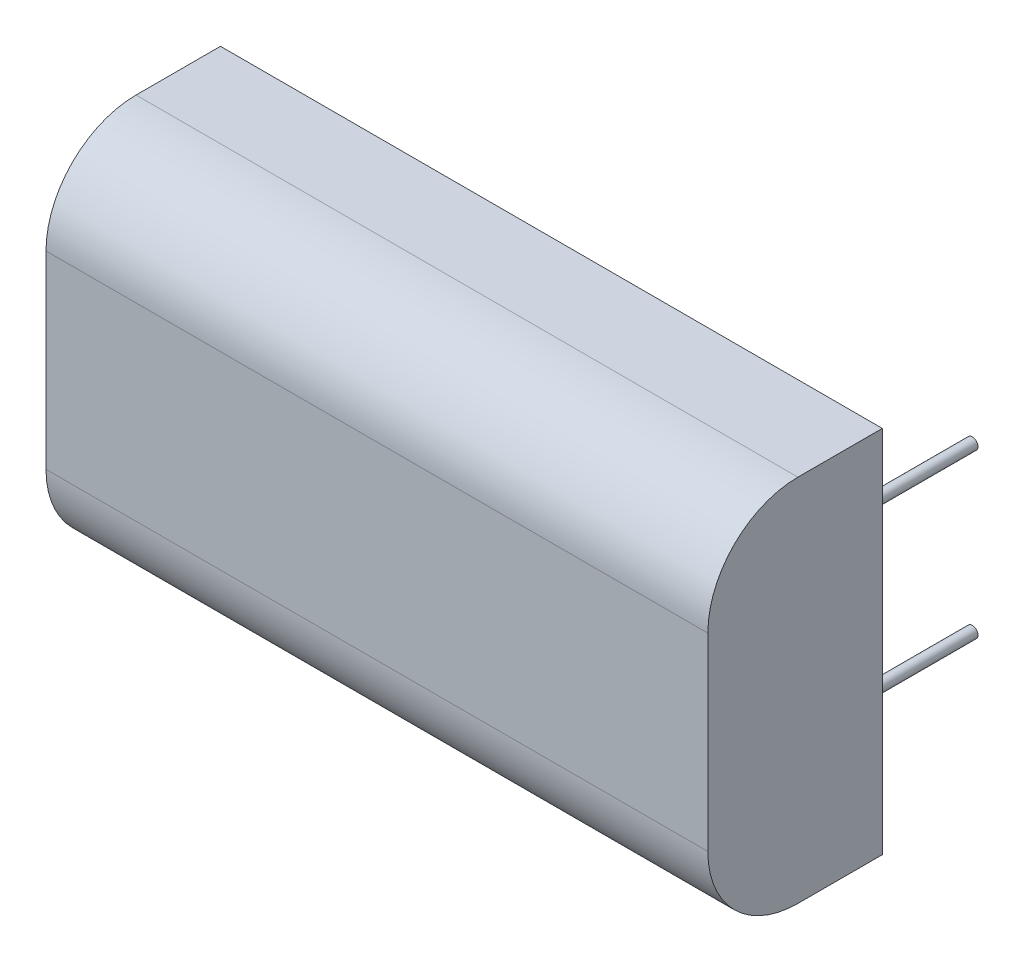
ISO-10303-21;
HEADER;
FILE_DESCRIPTION(('STEP AP214'),'2;1');
FILE_NAME('part.step','',(''),(''),'','','');
FILE_SCHEMA(('AUTOMOTIVE_DESIGN { 1 0 10303 214 1 1 1 1 }'));
ENDSEC;
DATA;
#1=APPLICATION_CONTEXT('core data for automotive mechanical design processes');
#2=APPLICATION_PROTOCOL_DEFINITION('international standard','automotive_design',2000,#1);
#3=PRODUCT_CONTEXT('',#1,'mechanical');
#4=PRODUCT('Part','Part','',(#3));
#5=PRODUCT_RELATED_PRODUCT_CATEGORY('part','',(#4));
#6=PRODUCT_DEFINITION_FORMATION('','',#4);
#7=PRODUCT_DEFINITION_CONTEXT('part definition',#1,'design');
#8=PRODUCT_DEFINITION('design','',#6,#7);
#9=PRODUCT_DEFINITION_SHAPE('','',#8);
#10=(LENGTH_UNIT() NAMED_UNIT(*) SI_UNIT(.MILLI.,.METRE.));
#11=(NAMED_UNIT(*) PLANE_ANGLE_UNIT() SI_UNIT($,.RADIAN.));
#12=(NAMED_UNIT(*) SI_UNIT($,.STERADIAN.) SOLID_ANGLE_UNIT());
#13=UNCERTAINTY_MEASURE_WITH_UNIT(LENGTH_MEASURE(1.E-05),#10,'distance_accuracy_value','');
#14=(GEOMETRIC_REPRESENTATION_CONTEXT(3) GLOBAL_UNCERTAINTY_ASSIGNED_CONTEXT((#13)) GLOBAL_UNIT_ASSIGNED_CONTEXT((#10,
#11,#12)) REPRESENTATION_CONTEXT('',''));
#15=CARTESIAN_POINT('',(0.,0.,0.));
#16=DIRECTION('',(0.,0.,1.));
#17=DIRECTION('',(1.,0.,0.));
#18=AXIS2_PLACEMENT_3D('',#15,#16,#17);
#19=CARTESIAN_POINT('',(29.4,-16.4,7.75));
#20=DIRECTION('',(0.,0.,-1.));
#21=DIRECTION('',(-1.,0.,0.));
#22=AXIS2_PLACEMENT_3D('',#19,#20,#21);
#23=PLANE('',#22);
#24=DIRECTION('',(0.,-1.,0.));
#25=VECTOR('',#24,1.);
#26=CARTESIAN_POINT('',(-29.4,-16.4,7.75));
#27=LINE('',#26,#25);
#28=CARTESIAN_POINT('',(-29.4,8.4,7.75));
#29=VERTEX_POINT('',#28);
#30=CARTESIAN_POINT('',(-29.4,-8.4,7.75));
#31=VERTEX_POINT('',#30);
#32=EDGE_CURVE('E136',#29,#31,#27,.T.);
#33=ORIENTED_EDGE('',*,*,#32,.T.);
#34=DIRECTION('',(-1.,0.,0.));
#35=VECTOR('',#34,1.);
#36=CARTESIAN_POINT('',(29.4,-8.4,7.75));
#37=LINE('',#36,#35);
#38=CARTESIAN_POINT('',(29.4,-8.4,7.75));
#39=VERTEX_POINT('',#38);
#40=EDGE_CURVE('E69',#31,#39,#37,.F.);
#41=ORIENTED_EDGE('',*,*,#40,.T.);
#42=DIRECTION('',(0.,-1.,0.));
#43=VECTOR('',#42,1.);
#44=CARTESIAN_POINT('',(29.4,-16.4,7.75));
#45=LINE('',#44,#43);
#46=CARTESIAN_POINT('',(29.4,8.4,7.75));
#47=VERTEX_POINT('',#46);
#48=EDGE_CURVE('E114',#47,#39,#45,.T.);
#49=ORIENTED_EDGE('',*,*,#48,.F.);
#50=DIRECTION('',(-1.,0.,0.));
#51=VECTOR('',#50,1.);
#52=CARTESIAN_POINT('',(29.4,8.4,7.75));
#53=LINE('',#52,#51);
#54=EDGE_CURVE('E158',#47,#29,#53,.T.);
#55=ORIENTED_EDGE('',*,*,#54,.T.);
#56=EDGE_LOOP('',(#33,#41,#49,#55));
#57=FACE_BOUND('',#56,.T.);
#58=ADVANCED_FACE('F45',(#57),#23,.F.);
#59=CARTESIAN_POINT('',(29.4,-16.4,-7.75));
#60=DIRECTION('',(0.,1.,0.));
#61=DIRECTION('',(0.,0.,1.));
#62=AXIS2_PLACEMENT_3D('',#59,#60,#61);
#63=PLANE('',#62);
#64=DIRECTION('',(0.,0.,-1.));
#65=VECTOR('',#64,1.);
#66=CARTESIAN_POINT('',(29.4,-16.4,-7.75));
#67=LINE('',#66,#65);
#68=CARTESIAN_POINT('',(29.4,-16.4,-0.250000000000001));
#69=VERTEX_POINT('',#68);
#70=CARTESIAN_POINT('',(29.4,-16.4,-7.75));
#71=VERTEX_POINT('',#70);
#72=EDGE_CURVE('E102',#69,#71,#67,.T.);
#73=ORIENTED_EDGE('',*,*,#72,.F.);
#74=DIRECTION('',(-1.,0.,0.));
#75=VECTOR('',#74,1.);
#76=CARTESIAN_POINT('',(29.4,-16.4,-0.250000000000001));
#77=LINE('',#76,#75);
#78=CARTESIAN_POINT('',(-29.4,-16.4,-0.250000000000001));
#79=VERTEX_POINT('',#78);
#80=EDGE_CURVE('E124',#69,#79,#77,.T.);
#81=ORIENTED_EDGE('',*,*,#80,.T.);
#82=DIRECTION('',(0.,0.,-1.));
#83=VECTOR('',#82,1.);
#84=CARTESIAN_POINT('',(-29.4,-16.4,-7.75));
#85=LINE('',#84,#83);
#86=CARTESIAN_POINT('',(-29.4,-16.4,-7.75));
#87=VERTEX_POINT('',#86);
#88=EDGE_CURVE('E120',#79,#87,#85,.T.);
#89=ORIENTED_EDGE('',*,*,#88,.T.);
#90=DIRECTION('',(-1.,0.,0.));
#91=VECTOR('',#90,1.);
#92=CARTESIAN_POINT('',(29.4,-16.4,-7.75));
#93=LINE('',#92,#91);
#94=EDGE_CURVE('E117',#71,#87,#93,.T.);
#95=ORIENTED_EDGE('',*,*,#94,.F.);
#96=EDGE_LOOP('',(#73,#81,#89,#95));
#97=FACE_BOUND('',#96,.T.);
#98=ADVANCED_FACE('F118',(#97),#63,.F.);
#99=CARTESIAN_POINT('',(29.4,-16.4,-7.75));
#100=DIRECTION('',(0.,0.,1.));
#101=DIRECTION('',(1.,0.,0.));
#102=AXIS2_PLACEMENT_3D('',#99,#100,#101);
#103=PLANE('',#102);
#104=CARTESIAN_POINT('',(25.4,-7.25,-7.75));
#105=DIRECTION('',(0.,0.,1.));
#106=DIRECTION('',(1.,0.,0.));
#107=AXIS2_PLACEMENT_3D('',#104,#105,#106);
#108=CIRCLE('',#107,0.499999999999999);
#109=CARTESIAN_POINT('',(25.9,-7.25,-7.75));
#110=VERTEX_POINT('',#109);
#111=EDGE_CURVE('E11',#110,#110,#108,.F.);
#112=ORIENTED_EDGE('',*,*,#111,.F.);
#113=EDGE_LOOP('',(#112));
#114=FACE_BOUND('',#113,.T.);
#115=CARTESIAN_POINT('',(25.4,7.25,-7.75));
#116=DIRECTION('',(0.,0.,1.));
#117=DIRECTION('',(1.,0.,0.));
#118=AXIS2_PLACEMENT_3D('',#115,#116,#117);
#119=CIRCLE('',#118,0.499999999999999);
#120=CARTESIAN_POINT('',(25.9,7.25,-7.75));
#121=VERTEX_POINT('',#120);
#122=EDGE_CURVE('E54',#121,#121,#119,.F.);
#123=ORIENTED_EDGE('',*,*,#122,.F.);
#124=EDGE_LOOP('',(#123));
#125=FACE_BOUND('',#124,.T.);
#126=DIRECTION('',(0.,1.,0.));
#127=VECTOR('',#126,1.);
#128=CARTESIAN_POINT('',(-29.4,-16.4,-7.75));
#129=LINE('',#128,#127);
#130=CARTESIAN_POINT('',(-29.4,16.4,-7.75));
#131=VERTEX_POINT('',#130);
#132=EDGE_CURVE('E142',#87,#131,#129,.T.);
#133=ORIENTED_EDGE('',*,*,#132,.T.);
#134=DIRECTION('',(-1.,0.,0.));
#135=VECTOR('',#134,1.);
#136=CARTESIAN_POINT('',(29.4,16.4,-7.75));
#137=LINE('',#136,#135);
#138=CARTESIAN_POINT('',(29.4,16.4,-7.75));
#139=VERTEX_POINT('',#138);
#140=EDGE_CURVE('E125',#139,#131,#137,.T.);
#141=ORIENTED_EDGE('',*,*,#140,.F.);
#142=DIRECTION('',(0.,1.,0.));
#143=VECTOR('',#142,1.);
#144=CARTESIAN_POINT('',(29.4,-16.4,-7.75));
#145=LINE('',#144,#143);
#146=EDGE_CURVE('E106',#71,#139,#145,.T.);
#147=ORIENTED_EDGE('',*,*,#146,.F.);
#148=ORIENTED_EDGE('',*,*,#94,.T.);
#149=EDGE_LOOP('',(#133,#141,#147,#148));
#150=FACE_BOUND('',#149,.T.);
#151=ADVANCED_FACE('F127',(#114,#125,#150),#103,.F.);
#152=CARTESIAN_POINT('',(29.4,16.4,-7.75));
#153=DIRECTION('',(0.,-1.,0.));
#154=DIRECTION('',(0.,0.,-1.));
#155=AXIS2_PLACEMENT_3D('',#152,#153,#154);
#156=PLANE('',#155);
#157=DIRECTION('',(0.,0.,1.));
#158=VECTOR('',#157,1.);
#159=CARTESIAN_POINT('',(-29.4,16.4,-7.75));
#160=LINE('',#159,#158);
#161=CARTESIAN_POINT('',(-29.4,16.4,-0.250000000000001));
#162=VERTEX_POINT('',#161);
#163=EDGE_CURVE('E145',#131,#162,#160,.T.);
#164=ORIENTED_EDGE('',*,*,#163,.T.);
#165=DIRECTION('',(-1.,0.,0.));
#166=VECTOR('',#165,1.);
#167=CARTESIAN_POINT('',(29.4,16.4,-0.250000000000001));
#168=LINE('',#167,#166);
#169=CARTESIAN_POINT('',(29.4,16.4,-0.250000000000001));
#170=VERTEX_POINT('',#169);
#171=EDGE_CURVE('E61',#162,#170,#168,.F.);
#172=ORIENTED_EDGE('',*,*,#171,.T.);
#173=DIRECTION('',(0.,0.,1.));
#174=VECTOR('',#173,1.);
#175=CARTESIAN_POINT('',(29.4,16.4,-7.75));
#176=LINE('',#175,#174);
#177=EDGE_CURVE('E130',#139,#170,#176,.T.);
#178=ORIENTED_EDGE('',*,*,#177,.F.);
#179=ORIENTED_EDGE('',*,*,#140,.T.);
#180=EDGE_LOOP('',(#164,#172,#178,#179));
#181=FACE_BOUND('',#180,.T.);
#182=ADVANCED_FACE('F177',(#181),#156,.F.);
#183=CARTESIAN_POINT('',(29.4,0.,0.));
#184=DIRECTION('',(1.,0.,0.));
#185=DIRECTION('',(0.,0.,-1.));
#186=AXIS2_PLACEMENT_3D('',#183,#184,#185);
#187=PLANE('',#186);
#188=ORIENTED_EDGE('',*,*,#48,.T.);
#189=CARTESIAN_POINT('',(29.4,-8.4,-0.250000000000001));
#190=DIRECTION('',(1.,0.,0.));
#191=DIRECTION('',(0.,0.,-1.));
#192=AXIS2_PLACEMENT_3D('',#189,#190,#191);
#193=CIRCLE('',#192,8.);
#194=EDGE_CURVE('E109',#39,#69,#193,.T.);
#195=ORIENTED_EDGE('',*,*,#194,.T.);
#196=ORIENTED_EDGE('',*,*,#72,.T.);
#197=ORIENTED_EDGE('',*,*,#146,.T.);
#198=ORIENTED_EDGE('',*,*,#177,.T.);
#199=CARTESIAN_POINT('',(29.4,8.4,-0.250000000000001));
#200=DIRECTION('',(1.,0.,0.));
#201=DIRECTION('',(0.,0.,-1.));
#202=AXIS2_PLACEMENT_3D('',#199,#200,#201);
#203=CIRCLE('',#202,8.);
#204=EDGE_CURVE('E164',#170,#47,#203,.T.);
#205=ORIENTED_EDGE('',*,*,#204,.T.);
#206=EDGE_LOOP('',(#188,#195,#196,#197,#198,#205));
#207=FACE_BOUND('',#206,.T.);
#208=ADVANCED_FACE('F104',(#207),#187,.T.);
#209=CARTESIAN_POINT('',(-29.4,0.,0.));
#210=DIRECTION('',(1.,0.,0.));
#211=DIRECTION('',(0.,0.,-1.));
#212=AXIS2_PLACEMENT_3D('',#209,#210,#211);
#213=PLANE('',#212);
#214=ORIENTED_EDGE('',*,*,#88,.F.);
#215=CARTESIAN_POINT('',(-29.4,-8.4,-0.250000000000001));
#216=DIRECTION('',(1.,0.,0.));
#217=DIRECTION('',(0.,0.,-1.));
#218=AXIS2_PLACEMENT_3D('',#215,#216,#217);
#219=CIRCLE('',#218,8.);
#220=EDGE_CURVE('E155',#79,#31,#219,.F.);
#221=ORIENTED_EDGE('',*,*,#220,.T.);
#222=ORIENTED_EDGE('',*,*,#32,.F.);
#223=CARTESIAN_POINT('',(-29.4,8.4,-0.250000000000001));
#224=DIRECTION('',(1.,0.,0.));
#225=DIRECTION('',(0.,0.,-1.));
#226=AXIS2_PLACEMENT_3D('',#223,#224,#225);
#227=CIRCLE('',#226,8.);
#228=EDGE_CURVE('E152',#29,#162,#227,.F.);
#229=ORIENTED_EDGE('',*,*,#228,.T.);
#230=ORIENTED_EDGE('',*,*,#163,.F.);
#231=ORIENTED_EDGE('',*,*,#132,.F.);
#232=EDGE_LOOP('',(#214,#221,#222,#229,#230,#231));
#233=FACE_BOUND('',#232,.T.);
#234=ADVANCED_FACE('F195',(#233),#213,.F.);
#235=CARTESIAN_POINT('',(29.4,-8.4,-0.250000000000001));
#236=DIRECTION('',(-1.,0.,0.));
#237=DIRECTION('',(0.,0.,1.));
#238=AXIS2_PLACEMENT_3D('',#235,#236,#237);
#239=CYLINDRICAL_SURFACE('',#238,8.);
#240=ORIENTED_EDGE('',*,*,#194,.F.);
#241=ORIENTED_EDGE('',*,*,#40,.F.);
#242=ORIENTED_EDGE('',*,*,#220,.F.);
#243=ORIENTED_EDGE('',*,*,#80,.F.);
#244=EDGE_LOOP('',(#240,#241,#242,#243));
#245=FACE_BOUND('',#244,.T.);
#246=ADVANCED_FACE('F193',(#245),#239,.T.);
#247=CARTESIAN_POINT('',(29.4,8.4,-0.250000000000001));
#248=DIRECTION('',(-1.,0.,0.));
#249=DIRECTION('',(0.,0.,1.));
#250=AXIS2_PLACEMENT_3D('',#247,#248,#249);
#251=CYLINDRICAL_SURFACE('',#250,8.);
#252=ORIENTED_EDGE('',*,*,#204,.F.);
#253=ORIENTED_EDGE('',*,*,#171,.F.);
#254=ORIENTED_EDGE('',*,*,#228,.F.);
#255=ORIENTED_EDGE('',*,*,#54,.F.);
#256=EDGE_LOOP('',(#252,#253,#254,#255));
#257=FACE_BOUND('',#256,.T.);
#258=ADVANCED_FACE('F47',(#257),#251,.T.);
#259=CARTESIAN_POINT('',(25.4,7.25,-19.75));
#260=DIRECTION('',(0.,0.,1.));
#261=DIRECTION('',(1.,0.,0.));
#262=AXIS2_PLACEMENT_3D('',#259,#260,#261);
#263=CYLINDRICAL_SURFACE('',#262,0.499999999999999);
#264=CARTESIAN_POINT('',(25.4,7.25,-19.75));
#265=DIRECTION('',(0.,0.,-1.));
#266=DIRECTION('',(-1.,0.,0.));
#267=AXIS2_PLACEMENT_3D('',#264,#265,#266);
#268=CIRCLE('',#267,0.499999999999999);
#269=CARTESIAN_POINT('',(24.9,7.25,-19.75));
#270=VERTEX_POINT('',#269);
#271=EDGE_CURVE('E139',#270,#270,#268,.T.);
#272=ORIENTED_EDGE('',*,*,#271,.F.);
#273=EDGE_LOOP('',(#272));
#274=FACE_BOUND('',#273,.T.);
#275=ORIENTED_EDGE('',*,*,#122,.T.);
#276=EDGE_LOOP('',(#275));
#277=FACE_BOUND('',#276,.T.);
#278=ADVANCED_FACE('F174',(#274,#277),#263,.T.);
#279=CARTESIAN_POINT('',(25.4,7.25,-19.75));
#280=DIRECTION('',(0.,0.,-1.));
#281=DIRECTION('',(-1.,0.,0.));
#282=AXIS2_PLACEMENT_3D('',#279,#280,#281);
#283=PLANE('',#282);
#284=ORIENTED_EDGE('',*,*,#271,.T.);
#285=EDGE_LOOP('',(#284));
#286=FACE_BOUND('',#285,.T.);
#287=ADVANCED_FACE('F223',(#286),#283,.T.);
#288=CARTESIAN_POINT('',(25.4,-7.25,-19.75));
#289=DIRECTION('',(0.,0.,1.));
#290=DIRECTION('',(1.,0.,0.));
#291=AXIS2_PLACEMENT_3D('',#288,#289,#290);
#292=CYLINDRICAL_SURFACE('',#291,0.499999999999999);
#293=CARTESIAN_POINT('',(25.4,-7.25,-19.75));
#294=DIRECTION('',(0.,0.,-1.));
#295=DIRECTION('',(-1.,0.,0.));
#296=AXIS2_PLACEMENT_3D('',#293,#294,#295);
#297=CIRCLE('',#296,0.499999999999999);
#298=CARTESIAN_POINT('',(24.9,-7.25,-19.75));
#299=VERTEX_POINT('',#298);
#300=EDGE_CURVE('E213',#299,#299,#297,.T.);
#301=ORIENTED_EDGE('',*,*,#300,.F.);
#302=EDGE_LOOP('',(#301));
#303=FACE_BOUND('',#302,.T.);
#304=ORIENTED_EDGE('',*,*,#111,.T.);
#305=EDGE_LOOP('',(#304));
#306=FACE_BOUND('',#305,.T.);
#307=ADVANCED_FACE('F220',(#303,#306),#292,.T.);
#308=CARTESIAN_POINT('',(25.4,-7.25,-19.75));
#309=DIRECTION('',(0.,0.,-1.));
#310=DIRECTION('',(-1.,0.,0.));
#311=AXIS2_PLACEMENT_3D('',#308,#309,#310);
#312=PLANE('',#311);
#313=ORIENTED_EDGE('',*,*,#300,.T.);
#314=EDGE_LOOP('',(#313));
#315=FACE_BOUND('',#314,.T.);
#316=ADVANCED_FACE('F218',(#315),#312,.T.);
#317=CLOSED_SHELL('',(#58,#98,#151,#182,#208,#234,#246,#258,#278,#287,#307,#316));
#318=MANIFOLD_SOLID_BREP('B2',#317);
#319=ADVANCED_BREP_SHAPE_REPRESENTATION('',(#18,#318),#14);
#320=SHAPE_DEFINITION_REPRESENTATION(#9,#319);
ENDSEC;
END-ISO-10303-21;
